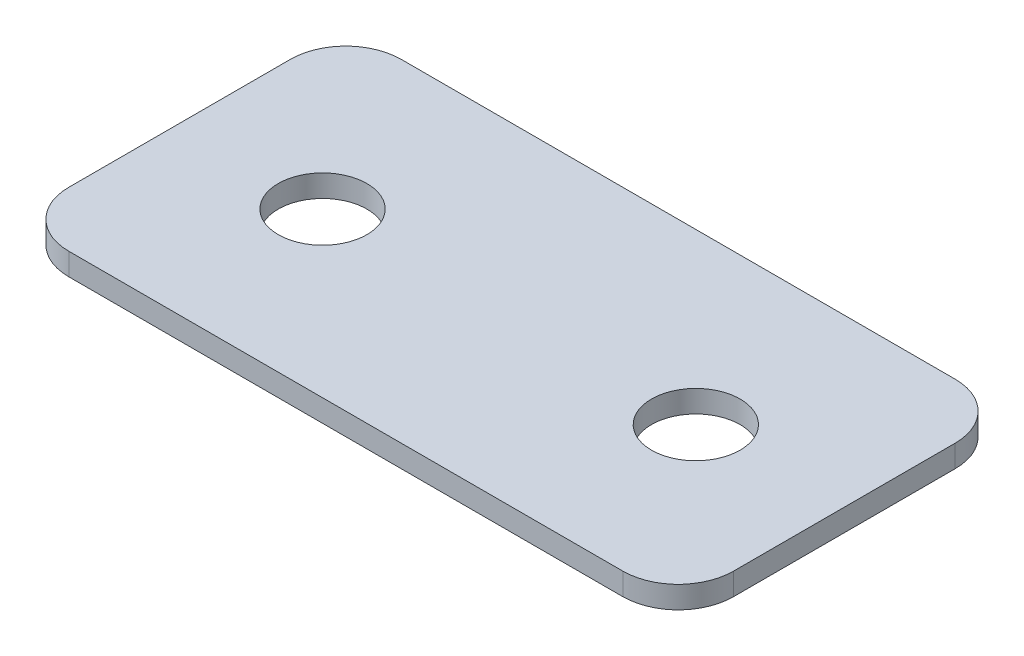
from build123d import *

# Parameters (mm, degrees)
EXTRUDE_1_DEPTH     = 26
CUT_EXTRUDE_1_DEPTH = 15
CUT_EXTRUDE_2_DEPTH = 13
CUT_EXTRUDE_3_DEPTH = 3
SKETCH_4_R          = 4
CUT_EXTRUDE_4_DEPTH = 5
CUT_EXTRUDE_5_DEPTH = 68.178330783
SKETCH_7_W          = 68.842653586
SKETCH_7_H          = 38.311408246
CUT_EXTRUDE_7_DEPTH = 3
SKETCH_8_W          = 71.267746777
SKETCH_8_H          = 39.031871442
CUT_EXTRUDE_8_DEPTH = 6


with BuildPart() as part:
    # Sketch 1 → Extrude 1 (new body)
    with BuildSketch(Plane(origin=(0, 0, 0), x_dir=(1, 0, 0), z_dir=(0, 1, 0))):
        with BuildLine():
            ThreePointArc((-36.372007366, 5.05801105), (-33.443075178, 12.129078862), (-26.372007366, 15.05801105))
            Line((-26.372007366, 15.05801105), (32.627992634, 15.05801105))
            ThreePointArc((32.627992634, 15.05801105), (39.699060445, 12.129078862), (42.627992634, 5.05801105))
            Line((42.627992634, 5.05801105), (42.627992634, -34.94198895))
            ThreePointArc((42.627992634, -34.94198895), (39.699060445, -42.013056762), (32.627992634, -44.94198895))
            Line((32.627992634, -44.94198895), (-26.372007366, -44.94198895))
            ThreePointArc((-26.372007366, -44.94198895), (-33.443075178, -42.013056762), (-36.372007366, -34.94198895))
            Line((-36.372007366, -34.94198895), (-36.372007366, 5.05801105))
        make_face()
    extrude(amount=EXTRUDE_1_DEPTH)

    # Sketch 2 → Cut-Extrude 1 (cut)
    with BuildSketch(Plane(origin=(0, 26, 0), x_dir=(1, 0, 0), z_dir=(0, 1, 0))):
        with BuildLine():
            Line((28.127992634, -37.94198895), (-21.872007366, -37.94198895))
            ThreePointArc((-21.872007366, -37.94198895), (-25.407541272, -36.477522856), (-26.872007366, -32.94198895))
            Line((-26.872007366, -32.94198895), (-26.872007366, -12.94198895))
            ThreePointArc((-26.872007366, -12.94198895), (-25.407541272, -9.406455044), (-21.872007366, -7.94198895))
            Line((-21.872007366, -7.94198895), (28.127992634, -7.94198895))
            ThreePointArc((28.127992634, -7.94198895), (31.663526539, -9.406455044), (33.127992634, -12.94198895))
            Line((33.127992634, -12.94198895), (33.127992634, -32.94198895))
            ThreePointArc((33.127992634, -32.94198895), (31.663526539, -36.477522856), (28.127992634, -37.94198895))
        make_face()
    extrude(amount=-CUT_EXTRUDE_1_DEPTH, mode=Mode.SUBTRACT)

    # Sketch 2_5 → Cut-Extrude 2 (cut)
    with BuildSketch(Plane(origin=(0, 26, 0), x_dir=(1, 0, 0), z_dir=(0, 1, 0))):
        with BuildLine():
            Line((-19.372007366, -7.94198895), (25.627992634, -7.94198895))
            Line((25.627992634, -7.94198895), (25.627992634, 2.05801105))
            ThreePointArc((25.627992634, 2.05801105), (24.163526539, 5.593544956), (20.627992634, 7.05801105))
            Line((20.627992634, 7.05801105), (-14.372007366, 7.05801105))
            ThreePointArc((-14.372007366, 7.05801105), (-17.907541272, 5.593544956), (-19.372007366, 2.05801105))
            Line((-19.372007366, 2.05801105), (-19.372007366, -7.94198895))
        make_face()
    extrude(amount=-CUT_EXTRUDE_2_DEPTH, mode=Mode.SUBTRACT)

    # Sketch 3 → Cut-Extrude 3 (cut)
    with BuildSketch(Plane(origin=(0, 11, 0), x_dir=(1, 0, 0), z_dir=(0, 1, 0))):
        with BuildLine():
            ThreePointArc((-16.715889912, -17.999323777), (-19.160677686, -25.716247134), (-11.694757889, -28.844814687))
            add(Edge.make_bspline(
                [(-11.694757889, -28.844814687), (-7.070667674, -27.190479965), (2.758354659, -25.914696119), (13.021491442, -27.05610032), (17.925131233, -28.835586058)],
                knots=[0.146877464, 0.146877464, 0.146877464, 0.146877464, 0.498521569, 0.873518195, 0.873518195, 0.873518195, 0.873518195], degree=3))
            ThreePointArc((17.925131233, -28.835586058), (25.410930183, -25.728592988), (22.971875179, -17.999323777))
            add(Edge.make_bspline(
                [(-16.715889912, -17.999323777), (-10.305938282, -14.298536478), (2.976905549, -11.649443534), (16.864097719, -14.472996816), (22.971875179, -17.999323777)],
                knots=[0, 0, 0, 0, 0.5, 1, 1, 1, 1], degree=3))
        make_face()
    extrude(amount=-CUT_EXTRUDE_3_DEPTH, mode=Mode.SUBTRACT)

    # Sketch 4 → Cut-Extrude 4 (cut)
    with BuildSketch(Plane(origin=(0, 8, 0), x_dir=(1, 0, 0), z_dir=(0, 1, 0))):
        with Locations(Location((-13.715889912, -23.1954762, 0), (0, 0, 270))):
            Circle(SKETCH_4_R)
        with Locations(Location((19.971875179, -23.1954762, 0), (0, 0, 270))):
            Circle(SKETCH_4_R)
    extrude(amount=-CUT_EXTRUDE_4_DEPTH, mode=Mode.SUBTRACT)

    # Sketch 2_6 → Cut-Extrude 5 (cut, through all)
    # profile 1 of 2: a face of its own
    with BuildSketch(Plane(origin=(0, 26, 0), x_dir=(1, 0, 0), z_dir=(0, 1, 0))):
        with BuildLine():
            Line((32.627992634, 15.05801105), (-26.372007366, 15.05801105))
            ThreePointArc((-26.372007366, 15.05801105), (-33.443075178, 12.129078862), (-36.372007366, 5.05801105))
            Line((-36.372007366, 5.05801105), (-36.372007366, -34.94198895))
            ThreePointArc((-36.372007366, -34.94198895), (-33.443075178, -42.013056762), (-26.372007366, -44.94198895))
            Line((-26.372007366, -44.94198895), (32.627992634, -44.94198895))
            ThreePointArc((32.627992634, -44.94198895), (39.699060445, -42.013056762), (42.627992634, -34.94198895))
            Line((42.627992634, -34.94198895), (42.627992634, 5.05801105))
            ThreePointArc((42.627992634, 5.05801105), (39.699060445, 12.129078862), (32.627992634, 15.05801105))
        make_face()
        with BuildLine():
            ThreePointArc((33.127992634, -32.94198895), (31.663526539, -36.477522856), (28.127992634, -37.94198895))
            Line((28.127992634, -37.94198895), (-21.872007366, -37.94198895))
            ThreePointArc((-21.872007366, -37.94198895), (-25.407541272, -36.477522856), (-26.872007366, -32.94198895))
            Line((-26.872007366, -32.94198895), (-26.872007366, -12.94198895))
            ThreePointArc((-26.872007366, -12.94198895), (-25.407541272, -9.406455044), (-21.872007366, -7.94198895))
            Line((-21.872007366, -7.94198895), (-19.372007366, -7.94198895))
            Line((-19.372007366, -7.94198895), (-19.372007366, 2.05801105))
            ThreePointArc((-19.372007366, 2.05801105), (-17.907541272, 5.593544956), (-14.372007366, 7.05801105))
            Line((-14.372007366, 7.05801105), (20.627992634, 7.05801105))
            ThreePointArc((20.627992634, 7.05801105), (24.163526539, 5.593544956), (25.627992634, 2.05801105))
            Line((25.627992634, 2.05801105), (25.627992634, -7.94198895))
            Line((25.627992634, -7.94198895), (28.127992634, -7.94198895))
            ThreePointArc((28.127992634, -7.94198895), (31.663526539, -9.406455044), (33.127992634, -12.94198895))
            Line((33.127992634, -12.94198895), (33.127992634, -32.94198895))
        make_face(mode=Mode.SUBTRACT)
    # profile 2 of 2: a face of its own
    with BuildSketch(Plane(origin=(0, 26, 0), x_dir=(1, 0, 0), z_dir=(0, 1, 0))):
        with BuildLine():
            Line((-19.372007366, -7.94198895), (25.627992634, -7.94198895))
            Line((25.627992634, -7.94198895), (25.627992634, 2.05801105))
            ThreePointArc((25.627992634, 2.05801105), (24.163526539, 5.593544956), (20.627992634, 7.05801105))
            Line((20.627992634, 7.05801105), (-14.372007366, 7.05801105))
            ThreePointArc((-14.372007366, 7.05801105), (-17.907541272, 5.593544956), (-19.372007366, 2.05801105))
            Line((-19.372007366, 2.05801105), (-19.372007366, -7.94198895))
        make_face()
    extrude(amount=-CUT_EXTRUDE_5_DEPTH, mode=Mode.SUBTRACT)

    # Sketch 7 → Cut-Extrude 7 (cut)
    with BuildSketch(Plane.XZ):
        with Locations((3.186933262, 23.384043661)):
            Rectangle(SKETCH_7_W, SKETCH_7_H)
    extrude(amount=-CUT_EXTRUDE_7_DEPTH, mode=Mode.SUBTRACT)

    # Sketch 8 → Cut-Extrude 8 (cut)
    with BuildSketch(Plane(origin=(0, 11, 0), x_dir=(1, 0, 0), z_dir=(0, 1, 0))):
        with Locations((2.316081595, -22.220290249)):
            Rectangle(SKETCH_8_W, SKETCH_8_H)
    extrude(amount=-CUT_EXTRUDE_8_DEPTH, mode=Mode.SUBTRACT)


solid = part.part
